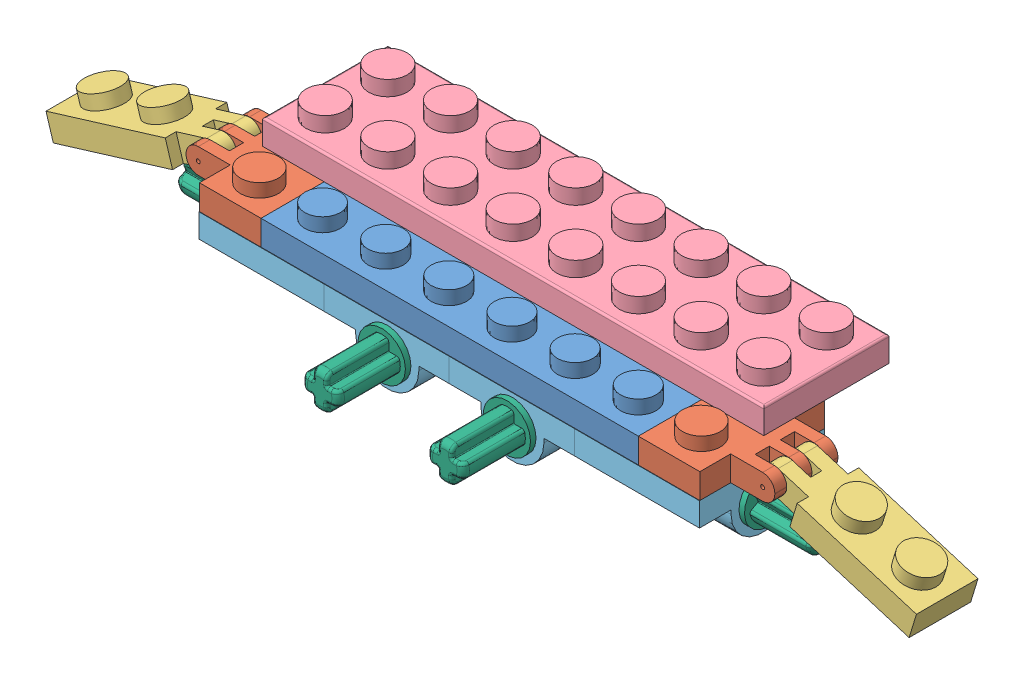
SolidWorks assembly Assem107.SLDASM, configuration Default (file format 4400). Lengths in mm.
Overall size (111.33 15.8 32.55).
14 component instances, 6 part files, 35 mates.
Components (placement in the parent):
- Part0L26Rood-1: Part0L26Rood.SLDPRT [Default] at origin size (47.8 4.91 15.8)
- Part0L2Rood scharnier-1: Part0L2Rood scharnier.SLDPRT [Default] at (23.9 -0.006 7.9) size (13.4 4.87 15.8)
- Part0L2Rood scharnier-2: Part0L2Rood scharnier.SLDPRT [Default] at (-23.9 -0.006 -7.9) x (-1 0 0) z (0 0 -1) size (13.4 4.87 15.8)
- Part0L2RoodB-1: Part0L2RoodB.SLDPRT [Default] at (39.1324 -1.1423 -3.87) x (0 0 1) z (-0.956305 0.292372 0) size (7.8 4.87 21.4)
- Part0L2RoodB-2: Part0L2RoodB.SLDPRT [Default] at (-39.1324 -1.1423 3.87) x (0 0 -1) z (0.956305 0.292372 0) size (7.8 4.87 21.4)
- Part0L28Rood-1: Part0L28Rood.SLDPRT [Default] at (0.05 -19.065 -8.0375) size (63.5 5.08 15.88)
- 2x2LRood+Enkel Bus-1: 2x2LRood+Enkel Bus.SLDPRT [기본 설정] at (23.7183 -0.006 -0.6276) x (0 0 -1) z (0 1 0) size (15.85 15.85 9.5)
- 2x2LRood+Enkel Bus-2: 2x2LRood+Enkel Bus.SLDPRT [기본 설정] at (-23.7183 -0.006 0.6776) x (0 0 1) z (0 1 0) size (15.85 15.85 9.5)
- 2x2LRood+Enkel Bus-3: 2x2LRood+Enkel Bus.SLDPRT [기본 설정] at (-7.2724 -0.006 -0.0317) x (1 0 0) z (0 1 0) size (15.85 15.85 9.5)
- 2x2LRood+Enkel Bus-4: 2x2LRood+Enkel Bus.SLDPRT [기본 설정] at (8.5776 -0.006 -0.0317) x (1 0 0) z (0 1 0) size (15.85 15.85 9.5)
- Axle Pin Grijs-1: Axle Pin Grijs.sldprt [Default] at (32.4 -3.506 -0.05) x (1 0 0) z (0 -0.468793 0.883308) size (16.56 6 6)
- Axle Pin Grijs-2: Axle Pin Grijs.sldprt [Default] at (-32.4 -3.506 0.1) x (-1 0 0) z (0 -0.924225 -0.381849) size (16.56 6 6)
- Axle Pin Grijs-3: Axle Pin Grijs.sldprt [Default] at (-7.85 -3.506 8.65) x (0 0 1) z (-1 0 0) size (16.56 6 6)
- Axle Pin Grijs-4: Axle Pin Grijs.sldprt [Default] at (8 -3.506 8.65) x (0 0 1) z (-1 0 0) size (16.56 6 6)
Mates (geometry in assembly coordinates):
- Coincident1: coincident aligned: plane of Part0L26Rood-1 through (23.9 3.16 7.9) normal (0 0 1); plane of Part0L2Rood scharnier-1 through (23.9 3.16 7.9) normal (0 0 1)
- Coincident2: coincident aligned: plane of Part0L26Rood-1 through (23.9 3.16 7.9) normal (0 0 1); plane of Part0L2Rood scharnier-2 through (-23.9 3.16 7.9) normal (0 0 1)
- Coincident3: coincident anti-aligned: plane of Part0L26Rood-1 through (-23.9 3.16 7.9) normal (-1 0 0); plane of Part0L2Rood scharnier-2 through (-23.9 3.16 -7.9) normal (1 0 0)
- Coincident4: coincident aligned: plane of Part0L26Rood-1 through (-23.9 3.16 -7.9) normal (0 1 0); plane of Part0L2Rood scharnier-2 through (-23.9 3.16 7.9) normal (0 1 0)
- Coincident5: coincident anti-aligned: plane of Part0L26Rood-1 through (23.9 3.16 7.9) normal (1 0 0); plane of Part0L2Rood scharnier-1 through (23.9 3.16 7.9) normal (-1 0 0)
- Coincident6: coincident aligned: plane of Part0L26Rood-1 through (-23.9 3.16 -7.9) normal (0 1 0); plane of Part0L2Rood scharnier-1 through (23.9 3.16 -7.9) normal (0 1 0)
- Concentric1: concentric anti-aligned: cylinder of Part0L2Rood scharnier-2 through (-35.75 1.544 7.9) axis (0 0 -1) radius 0.25; cylinder of Part0L2RoodB-2 through (-35.75 1.544 -3.93) axis (0 0 1) radius 0.25
- Coincident7: coincident anti-aligned: plane of Part0L2Rood scharnier-2 through (-33.3 3.16 0.7) normal (0 0 1); plane of Part0L2RoodB-2 through (-38.528 2.3532 0.7) normal (0 0 -1)
- Coincident8: coincident anti-aligned: plane of Part0L2Rood scharnier-1 through (33.3 3.16 -0.7) normal (0 0 -1); plane of Part0L2RoodB-1 through (38.528 2.3532 -0.7) normal (0 0 1)
- Concentric2: concentric anti-aligned: cylinder of Part0L2Rood scharnier-1 through (35.75 1.544 -7.9) axis (0 0 1) radius 0.25; cylinder of Part0L2RoodB-1 through (35.75 1.544 3.93) axis (0 0 -1) radius 0.25
- Angle1: planar angle = 0.296706 rad aligned: plane of Part0L2Rood scharnier-1 through (23.9 -0.006 -7.9) normal (0 -1 0); plane of Part0L2RoodB-1 through (54.242 -5.7618 -3.87) normal (-0.292372 -0.956305 0)
- Angle2: planar angle = 0.296706 rad aligned: plane of Part0L2RoodB-2 through (-54.242 -5.7618 3.87) normal (0.292372 -0.956305 0); plane of Part0L2Rood scharnier-2 through (-23.9 -0.006 7.9) normal (0 -1 0)
- Coincident11: coincident aligned: plane of Part0L2Rood scharnier-2 through (-31.7 3.16 -7.9) normal (-1 0 0); plane of Part0L28Rood-1 through (-31.7 6.335 -15.975) normal (-1 0 0)
- Coincident12: coincident anti-aligned: plane of Part0L26Rood-1 through (-23.9 3.16 -7.9) normal (0 1 0); plane of Part0L28Rood-1 through (-31.7 3.16 -0.1) normal (0 -1 0)
- Distance1: distance = 8 mm aligned: plane of Part0L26Rood-1 through (23.9 3.16 7.9) normal (0 0 1); plane of Part0L28Rood-1 through (31.8 6.335 -0.1) normal (0 0 1)
- Coincident14: coincident aligned: plane of 2x2LRood+Enkel Bus-1 through (31.7 -39.5278 7.95) normal (0 -1 0); plane of 2x2LRood+Enkel Bus-4 through (0 -39.5278 7.95) normal (0 -1 0)
- Coincident15: coincident aligned: plane of 2x2LRood+Enkel Bus-1 through (31.7 -39.5278 7.95) normal (0 -1 0); plane of 2x2LRood+Enkel Bus-3 through (-15.85 -39.5278 7.95) normal (0 -1 0)
- Coincident16: coincident aligned: plane of 2x2LRood+Enkel Bus-1 through (31.7 -39.5278 7.95) normal (0 -1 0); plane of 2x2LRood+Enkel Bus-2 through (-31.7 -39.5278 -7.9) normal (0 -1 0)
- Coincident17: coincident aligned: plane of 2x2LRood+Enkel Bus-1 through (15.85 -39.5278 -7.9) normal (0 0 -1); plane of 2x2LRood+Enkel Bus-4 through (0 -39.5278 -7.9) normal (0 0 -1)
- Coincident18: coincident aligned: plane of 2x2LRood+Enkel Bus-1 through (15.85 -39.5278 -7.9) normal (0 0 -1); plane of 2x2LRood+Enkel Bus-3 through (-15.85 -39.5278 -7.9) normal (0 0 -1)
- Coincident19: coincident aligned: plane of 2x2LRood+Enkel Bus-1 through (15.85 -39.5278 -7.9) normal (0 0 -1); plane of 2x2LRood+Enkel Bus-2 through (-15.85 -39.5278 -7.9) normal (0 0 -1)
- Coincident20: coincident anti-aligned: plane of 2x2LRood+Enkel Bus-1 through (15.85 -39.5278 7.95) normal (-1 0 0); plane of 2x2LRood+Enkel Bus-4 through (15.85 -39.5278 -7.9) normal (1 0 0)
- Coincident21: coincident anti-aligned: plane of 2x2LRood+Enkel Bus-3 through (0 -39.5278 -7.9) normal (1 0 0); plane of 2x2LRood+Enkel Bus-4 through (0 -39.5278 -7.9) normal (-1 0 0)
- Coincident22: coincident anti-aligned: plane of 2x2LRood+Enkel Bus-2 through (-15.85 -39.5278 -7.9) normal (1 0 0); plane of 2x2LRood+Enkel Bus-3 through (-15.85 -39.5278 -7.9) normal (-1 0 0)
- Coincident23: coincident aligned: plane of Part0L26Rood-1 through (23.9 3.16 -7.9) normal (0 0 -1); plane of 2x2LRood+Enkel Bus-1 through (15.85 -39.5278 -7.9) normal (0 0 -1)
- Coincident24: coincident aligned: plane of Part0L2Rood scharnier-2 through (-31.7 3.16 -7.9) normal (-1 0 0); plane of 2x2LRood+Enkel Bus-2 through (-31.7 -39.5278 -7.9) normal (-1 0 0)
- Coincident25: coincident anti-aligned: plane of Part0L2Rood scharnier-2 through (-23.9 -0.006 7.9) normal (0 -1 0); plane of 2x2LRood+Enkel Bus-2 through (-31.7 -0.006 -7.9) normal (0 1 0)
- Concentric3: concentric: cylinder of 2x2LRood+Enkel Bus-1 through (22.3 -3.506 -0.05) axis (1 0 0) radius 2.4; cylinder of Axle Pin Grijs-1 through (52.6835 -3.506 -0.05) axis (1 0 0) radius 2.3876
- Concentric4: concentric: cylinder of 2x2LRood+Enkel Bus-4 through (8 -3.506 -1.45) axis (0 0 1) radius 2.4; cylinder of Axle Pin Grijs-4 through (8 -3.506 23.5553) axis (0 0 1) radius 2.3876
- Concentric5: concentric: cylinder of 2x2LRood+Enkel Bus-3 through (-7.85 -3.506 -1.45) axis (0 0 1) radius 2.4; cylinder of Axle Pin Grijs-3 through (-7.85 -3.506 23.8967) axis (0 0 1) radius 2.3876
- Concentric6: concentric: cylinder of 2x2LRood+Enkel Bus-2 through (-22.3 -3.506 0.1) axis (-1 0 0) radius 2.4; cylinder of Axle Pin Grijs-2 through (-52.7185 -3.506 0.1) axis (-1 0 0) radius 2.3876
- Coincident26: coincident anti-aligned: plane of 2x2LRood+Enkel Bus-2 through (-31 -3.506 0.1) normal (-1 0 0); plane of Axle Pin Grijs-2 through (-31 -3.506 0.1) normal (1 0 0)
- Coincident27: coincident anti-aligned: plane of 2x2LRood+Enkel Bus-1 through (31 -3.506 -0.05) normal (1 0 0); plane of Axle Pin Grijs-1 through (31 -3.506 -0.05) normal (-1 0 0)
- Coincident28: coincident anti-aligned: plane of 2x2LRood+Enkel Bus-4 through (8 -3.506 7.25) normal (0 0 1); plane of Axle Pin Grijs-4 through (8 -3.506 7.25) normal (0 0 -1)
- Coincident29: coincident anti-aligned: plane of 2x2LRood+Enkel Bus-3 through (-7.85 -3.506 7.25) normal (0 0 1); plane of Axle Pin Grijs-3 through (-7.85 -3.506 7.25) normal (0 0 -1)
